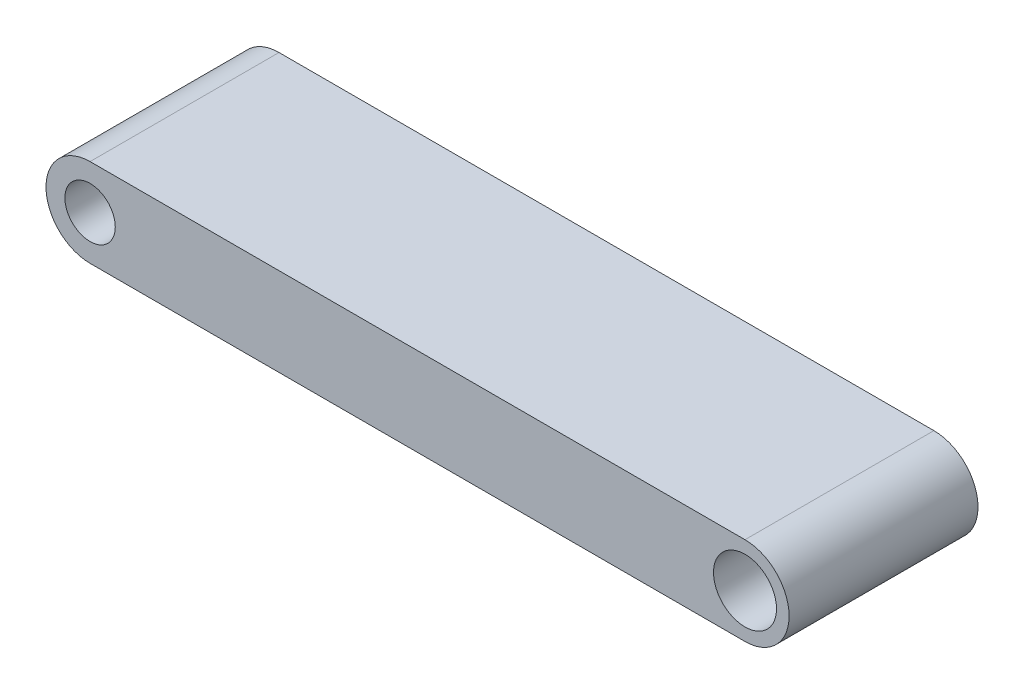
ISO-10303-21;
HEADER;
FILE_DESCRIPTION(('STEP AP214'),'2;1');
FILE_NAME('part.step','',(''),(''),'','','');
FILE_SCHEMA(('AUTOMOTIVE_DESIGN { 1 0 10303 214 1 1 1 1 }'));
ENDSEC;
DATA;
#1=APPLICATION_CONTEXT('core data for automotive mechanical design processes');
#2=APPLICATION_PROTOCOL_DEFINITION('international standard','automotive_design',2000,#1);
#3=PRODUCT_CONTEXT('',#1,'mechanical');
#4=PRODUCT('Part','Part','',(#3));
#5=PRODUCT_RELATED_PRODUCT_CATEGORY('part','',(#4));
#6=PRODUCT_DEFINITION_FORMATION('','',#4);
#7=PRODUCT_DEFINITION_CONTEXT('part definition',#1,'design');
#8=PRODUCT_DEFINITION('design','',#6,#7);
#9=PRODUCT_DEFINITION_SHAPE('','',#8);
#10=(LENGTH_UNIT() NAMED_UNIT(*) SI_UNIT(.MILLI.,.METRE.));
#11=(NAMED_UNIT(*) PLANE_ANGLE_UNIT() SI_UNIT($,.RADIAN.));
#12=(NAMED_UNIT(*) SI_UNIT($,.STERADIAN.) SOLID_ANGLE_UNIT());
#13=UNCERTAINTY_MEASURE_WITH_UNIT(LENGTH_MEASURE(1.E-05),#10,'distance_accuracy_value','');
#14=(GEOMETRIC_REPRESENTATION_CONTEXT(3) GLOBAL_UNCERTAINTY_ASSIGNED_CONTEXT((#13)) GLOBAL_UNIT_ASSIGNED_CONTEXT((#10,
#11,#12)) REPRESENTATION_CONTEXT('',''));
#15=CARTESIAN_POINT('',(0.,0.,0.));
#16=DIRECTION('',(0.,0.,1.));
#17=DIRECTION('',(1.,0.,0.));
#18=AXIS2_PLACEMENT_3D('',#15,#16,#17);
#19=CARTESIAN_POINT('',(26.,0.,7.5));
#20=DIRECTION('',(0.,0.,-1.));
#21=DIRECTION('',(-1.,0.,0.));
#22=AXIS2_PLACEMENT_3D('',#19,#20,#21);
#23=CYLINDRICAL_SURFACE('',#22,3.5);
#24=CARTESIAN_POINT('',(26.,0.,-7.5));
#25=DIRECTION('',(0.,0.,1.));
#26=DIRECTION('',(1.,0.,0.));
#27=AXIS2_PLACEMENT_3D('',#24,#25,#26);
#28=CIRCLE('',#27,3.5);
#29=CARTESIAN_POINT('',(26.,-3.49999999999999,-7.5));
#30=VERTEX_POINT('',#29);
#31=CARTESIAN_POINT('',(26.,3.5,-7.5));
#32=VERTEX_POINT('',#31);
#33=EDGE_CURVE('E97',#30,#32,#28,.T.);
#34=ORIENTED_EDGE('',*,*,#33,.T.);
#35=DIRECTION('',(0.,0.,-1.));
#36=VECTOR('',#35,1.);
#37=CARTESIAN_POINT('',(26.,3.5,7.5));
#38=LINE('',#37,#36);
#39=CARTESIAN_POINT('',(26.,3.5,7.5));
#40=VERTEX_POINT('',#39);
#41=EDGE_CURVE('E11',#40,#32,#38,.T.);
#42=ORIENTED_EDGE('',*,*,#41,.F.);
#43=CARTESIAN_POINT('',(26.,0.,7.5));
#44=DIRECTION('',(0.,0.,1.));
#45=DIRECTION('',(1.,0.,0.));
#46=AXIS2_PLACEMENT_3D('',#43,#44,#45);
#47=CIRCLE('',#46,3.5);
#48=CARTESIAN_POINT('',(26.,-3.49999999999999,7.5));
#49=VERTEX_POINT('',#48);
#50=EDGE_CURVE('E85',#49,#40,#47,.T.);
#51=ORIENTED_EDGE('',*,*,#50,.F.);
#52=DIRECTION('',(0.,0.,-1.));
#53=VECTOR('',#52,1.);
#54=CARTESIAN_POINT('',(26.,-3.49999999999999,7.5));
#55=LINE('',#54,#53);
#56=EDGE_CURVE('E93',#49,#30,#55,.T.);
#57=ORIENTED_EDGE('',*,*,#56,.T.);
#58=EDGE_LOOP('',(#34,#42,#51,#57));
#59=FACE_BOUND('',#58,.T.);
#60=ADVANCED_FACE('F34',(#59),#23,.T.);
#61=CARTESIAN_POINT('',(26.,3.5,7.5));
#62=DIRECTION('',(0.,-1.,0.));
#63=DIRECTION('',(1.,0.,0.));
#64=AXIS2_PLACEMENT_3D('',#61,#62,#63);
#65=PLANE('',#64);
#66=DIRECTION('',(-1.,0.,0.));
#67=VECTOR('',#66,1.);
#68=CARTESIAN_POINT('',(26.,3.5,-7.5));
#69=LINE('',#68,#67);
#70=CARTESIAN_POINT('',(-26.,3.5,-7.5));
#71=VERTEX_POINT('',#70);
#72=EDGE_CURVE('E89',#32,#71,#69,.T.);
#73=ORIENTED_EDGE('',*,*,#72,.T.);
#74=DIRECTION('',(0.,0.,-1.));
#75=VECTOR('',#74,1.);
#76=CARTESIAN_POINT('',(-26.,3.5,7.5));
#77=LINE('',#76,#75);
#78=CARTESIAN_POINT('',(-26.,3.5,7.5));
#79=VERTEX_POINT('',#78);
#80=EDGE_CURVE('E42',#79,#71,#77,.T.);
#81=ORIENTED_EDGE('',*,*,#80,.F.);
#82=DIRECTION('',(-1.,0.,0.));
#83=VECTOR('',#82,1.);
#84=CARTESIAN_POINT('',(26.,3.5,7.5));
#85=LINE('',#84,#83);
#86=EDGE_CURVE('E80',#40,#79,#85,.T.);
#87=ORIENTED_EDGE('',*,*,#86,.F.);
#88=ORIENTED_EDGE('',*,*,#41,.T.);
#89=EDGE_LOOP('',(#73,#81,#87,#88));
#90=FACE_BOUND('',#89,.T.);
#91=ADVANCED_FACE('F88',(#90),#65,.F.);
#92=CARTESIAN_POINT('',(-26.,0.,7.5));
#93=DIRECTION('',(0.,0.,-1.));
#94=DIRECTION('',(-1.,0.,0.));
#95=AXIS2_PLACEMENT_3D('',#92,#93,#94);
#96=CYLINDRICAL_SURFACE('',#95,3.5);
#97=CARTESIAN_POINT('',(-26.,0.,-7.5));
#98=DIRECTION('',(0.,0.,1.));
#99=DIRECTION('',(1.,0.,0.));
#100=AXIS2_PLACEMENT_3D('',#97,#98,#99);
#101=CIRCLE('',#100,3.5);
#102=CARTESIAN_POINT('',(-26.,-3.5,-7.5));
#103=VERTEX_POINT('',#102);
#104=EDGE_CURVE('E67',#71,#103,#101,.T.);
#105=ORIENTED_EDGE('',*,*,#104,.T.);
#106=DIRECTION('',(0.,0.,-1.));
#107=VECTOR('',#106,1.);
#108=CARTESIAN_POINT('',(-26.,-3.5,7.5));
#109=LINE('',#108,#107);
#110=CARTESIAN_POINT('',(-26.,-3.5,7.5));
#111=VERTEX_POINT('',#110);
#112=EDGE_CURVE('E90',#111,#103,#109,.T.);
#113=ORIENTED_EDGE('',*,*,#112,.F.);
#114=CARTESIAN_POINT('',(-26.,0.,7.5));
#115=DIRECTION('',(0.,0.,1.));
#116=DIRECTION('',(1.,0.,0.));
#117=AXIS2_PLACEMENT_3D('',#114,#115,#116);
#118=CIRCLE('',#117,3.5);
#119=EDGE_CURVE('E83',#79,#111,#118,.T.);
#120=ORIENTED_EDGE('',*,*,#119,.F.);
#121=ORIENTED_EDGE('',*,*,#80,.T.);
#122=EDGE_LOOP('',(#105,#113,#120,#121));
#123=FACE_BOUND('',#122,.T.);
#124=ADVANCED_FACE('F91',(#123),#96,.T.);
#125=CARTESIAN_POINT('',(26.,-3.49999999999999,7.5));
#126=DIRECTION('',(0.,1.,0.));
#127=DIRECTION('',(-1.,0.,0.));
#128=AXIS2_PLACEMENT_3D('',#125,#126,#127);
#129=PLANE('',#128);
#130=DIRECTION('',(1.,0.,0.));
#131=VECTOR('',#130,1.);
#132=CARTESIAN_POINT('',(26.,-3.49999999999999,-7.5));
#133=LINE('',#132,#131);
#134=EDGE_CURVE('E73',#103,#30,#133,.T.);
#135=ORIENTED_EDGE('',*,*,#134,.T.);
#136=ORIENTED_EDGE('',*,*,#56,.F.);
#137=DIRECTION('',(1.,0.,0.));
#138=VECTOR('',#137,1.);
#139=CARTESIAN_POINT('',(26.,-3.49999999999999,7.5));
#140=LINE('',#139,#138);
#141=EDGE_CURVE('E50',#111,#49,#140,.T.);
#142=ORIENTED_EDGE('',*,*,#141,.F.);
#143=ORIENTED_EDGE('',*,*,#112,.T.);
#144=EDGE_LOOP('',(#135,#136,#142,#143));
#145=FACE_BOUND('',#144,.T.);
#146=ADVANCED_FACE('F105',(#145),#129,.F.);
#147=CARTESIAN_POINT('',(26.,0.,7.5));
#148=DIRECTION('',(0.,0.,1.));
#149=DIRECTION('',(1.,0.,0.));
#150=AXIS2_PLACEMENT_3D('',#147,#148,#149);
#151=PLANE('',#150);
#152=CARTESIAN_POINT('',(-26.,0.,7.5));
#153=DIRECTION('',(0.,0.,1.));
#154=DIRECTION('',(1.,0.,0.));
#155=AXIS2_PLACEMENT_3D('',#152,#153,#154);
#156=CIRCLE('',#155,2.);
#157=CARTESIAN_POINT('',(-24.,0.,7.5));
#158=VERTEX_POINT('',#157);
#159=EDGE_CURVE('E117',#158,#158,#156,.T.);
#160=ORIENTED_EDGE('',*,*,#159,.F.);
#161=EDGE_LOOP('',(#160));
#162=FACE_BOUND('',#161,.T.);
#163=CARTESIAN_POINT('',(26.,0.,7.5));
#164=DIRECTION('',(0.,0.,1.));
#165=DIRECTION('',(1.,0.,0.));
#166=AXIS2_PLACEMENT_3D('',#163,#164,#165);
#167=CIRCLE('',#166,2.5);
#168=CARTESIAN_POINT('',(28.5,0.,7.5));
#169=VERTEX_POINT('',#168);
#170=EDGE_CURVE('E111',#169,#169,#167,.T.);
#171=ORIENTED_EDGE('',*,*,#170,.F.);
#172=EDGE_LOOP('',(#171));
#173=FACE_BOUND('',#172,.T.);
#174=ORIENTED_EDGE('',*,*,#50,.T.);
#175=ORIENTED_EDGE('',*,*,#86,.T.);
#176=ORIENTED_EDGE('',*,*,#119,.T.);
#177=ORIENTED_EDGE('',*,*,#141,.T.);
#178=EDGE_LOOP('',(#174,#175,#176,#177));
#179=FACE_BOUND('',#178,.T.);
#180=ADVANCED_FACE('F81',(#162,#173,#179),#151,.T.);
#181=CARTESIAN_POINT('',(26.,0.,-7.5));
#182=DIRECTION('',(0.,0.,1.));
#183=DIRECTION('',(1.,0.,0.));
#184=AXIS2_PLACEMENT_3D('',#181,#182,#183);
#185=PLANE('',#184);
#186=CARTESIAN_POINT('',(-26.,0.,-7.5));
#187=DIRECTION('',(0.,0.,1.));
#188=DIRECTION('',(1.,0.,0.));
#189=AXIS2_PLACEMENT_3D('',#186,#187,#188);
#190=CIRCLE('',#189,2.);
#191=CARTESIAN_POINT('',(-24.,0.,-7.5));
#192=VERTEX_POINT('',#191);
#193=EDGE_CURVE('E114',#192,#192,#190,.T.);
#194=ORIENTED_EDGE('',*,*,#193,.T.);
#195=EDGE_LOOP('',(#194));
#196=FACE_BOUND('',#195,.T.);
#197=CARTESIAN_POINT('',(26.,0.,-7.5));
#198=DIRECTION('',(0.,0.,1.));
#199=DIRECTION('',(1.,0.,0.));
#200=AXIS2_PLACEMENT_3D('',#197,#198,#199);
#201=CIRCLE('',#200,2.5);
#202=CARTESIAN_POINT('',(28.5,0.,-7.5));
#203=VERTEX_POINT('',#202);
#204=EDGE_CURVE('E100',#203,#203,#201,.T.);
#205=ORIENTED_EDGE('',*,*,#204,.T.);
#206=EDGE_LOOP('',(#205));
#207=FACE_BOUND('',#206,.T.);
#208=ORIENTED_EDGE('',*,*,#33,.F.);
#209=ORIENTED_EDGE('',*,*,#134,.F.);
#210=ORIENTED_EDGE('',*,*,#104,.F.);
#211=ORIENTED_EDGE('',*,*,#72,.F.);
#212=EDGE_LOOP('',(#208,#209,#210,#211));
#213=FACE_BOUND('',#212,.T.);
#214=ADVANCED_FACE('F108',(#196,#207,#213),#185,.F.);
#215=CARTESIAN_POINT('',(26.,0.,-7.5));
#216=DIRECTION('',(0.,0.,1.));
#217=DIRECTION('',(1.,0.,0.));
#218=AXIS2_PLACEMENT_3D('',#215,#216,#217);
#219=CYLINDRICAL_SURFACE('',#218,2.5);
#220=ORIENTED_EDGE('',*,*,#204,.F.);
#221=EDGE_LOOP('',(#220));
#222=FACE_BOUND('',#221,.T.);
#223=ORIENTED_EDGE('',*,*,#170,.T.);
#224=EDGE_LOOP('',(#223));
#225=FACE_BOUND('',#224,.T.);
#226=ADVANCED_FACE('F128',(#222,#225),#219,.F.);
#227=CARTESIAN_POINT('',(-26.,0.,-7.5));
#228=DIRECTION('',(0.,0.,1.));
#229=DIRECTION('',(1.,0.,0.));
#230=AXIS2_PLACEMENT_3D('',#227,#228,#229);
#231=CYLINDRICAL_SURFACE('',#230,2.);
#232=ORIENTED_EDGE('',*,*,#193,.F.);
#233=EDGE_LOOP('',(#232));
#234=FACE_BOUND('',#233,.T.);
#235=ORIENTED_EDGE('',*,*,#159,.T.);
#236=EDGE_LOOP('',(#235));
#237=FACE_BOUND('',#236,.T.);
#238=ADVANCED_FACE('F125',(#234,#237),#231,.F.);
#239=CLOSED_SHELL('',(#60,#91,#124,#146,#180,#214,#226,#238));
#240=MANIFOLD_SOLID_BREP('B2',#239);
#241=ADVANCED_BREP_SHAPE_REPRESENTATION('',(#18,#240),#14);
#242=SHAPE_DEFINITION_REPRESENTATION(#9,#241);
ENDSEC;
END-ISO-10303-21;
